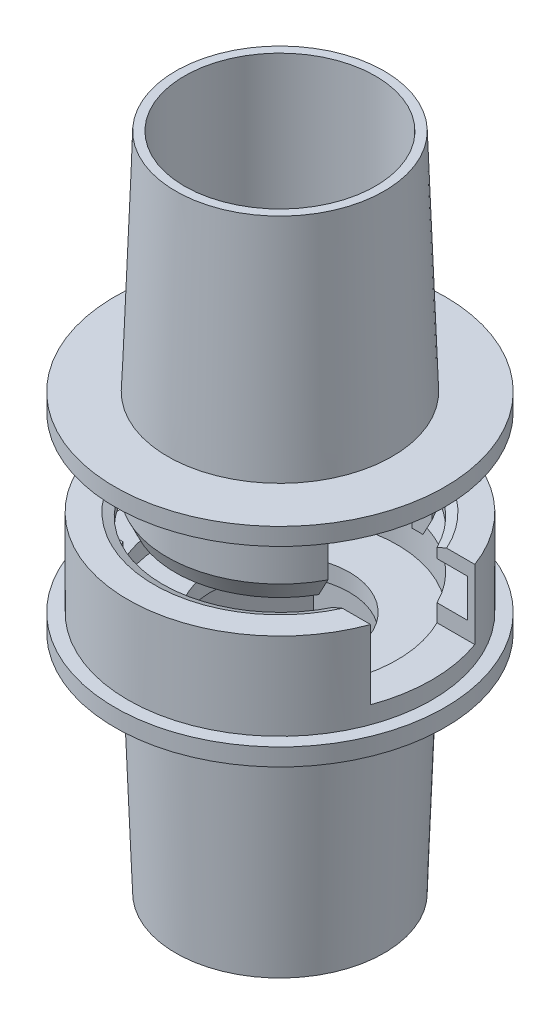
from build123d import *
from OCP.BRepFilletAPI import BRepFilletAPI_MakeChamfer

# Parameters (mm, degrees)
SKETCH4_R           = 6.5
SKETCH4_R_2         = 5.5
CUT_EXTRUDE2_DEPTH  = 28.504545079
SKETCH5_R           = 8.75
SKETCH5_R_2         = 6.75
BOSS_EXTRUDE1_DEPTH = 5
SKETCH6_R           = 8.35
SKETCH6_R_2         = 6.75
CUT_EXTRUDE3_DEPTH  = 2.2
CUT_EXTRUDE1_START  = -4
SKETCH3_W           = 19.395255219
SKETCH3_H           = 6
CUT_EXTRUDE1_DEPTH  = 8
CHAMFER1_SIZE       = 1
CHAMFER1_SIZE2      = 0.466307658
CHAMFER2_SIZE       = 0.5
CHAMFER2_SIZE2      = 0.233153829
SKETCH8_R           = 5.5
BOSS_EXTRUDE2_DEPTH = 13


with BuildPart() as part:
    # Sketch2 → Revolve1 (revolve)
    with BuildSketch(Plane.XY, mode=Mode.PRIVATE) as revolve1_sk:
        Polygon((-5.5, 14), (-6, 14), (-6.464285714, 1), (-9.5, 1), (-9.5, 0), (-6.5, 0), (-6.5, -5), (-5.5, -5), (-5.5, 0), (-4, 0), (-4, 1), (-5.5, 1), align=None)
    revolve(revolve1_sk.sketch.rotate(Axis((0, 0, 0), (0, 1, 0)), 270), axis=Axis((0, 0, 0), (0, 1, 0)))


with BuildPart() as body_2:
    # Mirror1: mirrored copy
    add(part.part.mirror(Plane(origin=(-5.5, -5, 0), x_dir=(0, 0, 1), z_dir=(0, 1, 0))))

    # Sketch4 → Cut-Extrude2 (cut, through all)
    with BuildSketch(Plane(origin=(0, -10, 0), x_dir=(1, 0, 0), z_dir=(0, 1, 0))):
        with Locations(Location((0, 0, 0), (0, 0, 90))):
            Circle(SKETCH4_R)
        with Locations(Location((0, 0, 0), (0, 0, 90))):
            Circle(SKETCH4_R_2, mode=Mode.SUBTRACT)
    extrude(amount=CUT_EXTRUDE2_DEPTH, mode=Mode.SUBTRACT)

    # Sketch5 → Boss-Extrude1 (add)
    with BuildSketch(Plane(origin=(0, -10, 0), x_dir=(1, 0, 0), z_dir=(0, 1, 0))):
        with Locations(Location((0, 0, 0), (0, 0, 270))):
            Circle(SKETCH5_R)
        with Locations(Location((0, 0, 0), (0, 0, 270))):
            Circle(SKETCH5_R_2, mode=Mode.SUBTRACT)
    extrude(amount=BOSS_EXTRUDE1_DEPTH)

    # Sketch6 → Cut-Extrude3 (cut)
    with BuildSketch(Plane(origin=(0, -8, 0), x_dir=(1, 0, 0), z_dir=(0, 1, 0))):
        with Locations(Location((0, 0, 0), (0, 0, 270))):
            Circle(SKETCH6_R)
        with Locations(Location((0, 0, 0), (0, 0, 270))):
            Circle(SKETCH6_R_2, mode=Mode.SUBTRACT)
    extrude(amount=CUT_EXTRUDE3_DEPTH, mode=Mode.SUBTRACT)


with BuildPart() as cut_extrude1_tool:
    # Sketch3 → Cut-Extrude1 (new body)
    with BuildSketch(Plane.XZ.offset(5).offset(CUT_EXTRUDE1_START)):
        with Locations((0.048246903, 0)):
            Rectangle(SKETCH3_W, SKETCH3_H)
    extrude(amount=CUT_EXTRUDE1_DEPTH)


with BuildPart() as part_1:
    add(part.part)

    # Cut-Extrude1: cut by cut_extrude1_tool
    add(cut_extrude1_tool.part, mode=Mode.SUBTRACT)

    # Chamfer1
    chamfer1_edges = [part_1.edges().sort_by_distance(p)[0] for p in [
        (0, -5, 6.5),
        (-3.372684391, -5, -5.556527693),
    ]]
    chamfer1_side = [part_1.faces().sort_by_distance(p)[0] for p in [
        (0, -2.5, 6.5),
    ]]
    chamfer(chamfer1_edges, length=CHAMFER1_SIZE, length2=CHAMFER1_SIZE2, reference=chamfer1_side[0])


with BuildPart() as body_2_1:
    add(body_2.part)

    # Cut-Extrude1: cut by cut_extrude1_tool
    add(cut_extrude1_tool.part, mode=Mode.SUBTRACT)

    # Chamfer2: one chamfer whose edges measure the first distance from different faces: ONE call of the kernel's chamfer builder (chamfer() names one face for all edges)
    chamfer2_edges_1 = [body_2_1.edges().sort_by_distance(p)[0] for p in [
        (0, -5, -6.75),
    ]]
    chamfer2_side_1 = [body_2_1.faces().sort_by_distance(p)[0] for p in [
        (7.133167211, -5, -3.174158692),
    ]]
    chamfer2_edges_2 = [body_2_1.edges().sort_by_distance(p)[0] for p in [
        (0, -5, 6.75),
    ]]
    chamfer2_side_2 = [body_2_1.faces().sort_by_distance(p)[0] for p in [
        (-4.915770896, -5, 7.02710827),
    ]]
    chamfer2 = BRepFilletAPI_MakeChamfer(body_2_1.part.solid().wrapped)
    for e in chamfer2_edges_1:
        chamfer2.Add(CHAMFER2_SIZE, CHAMFER2_SIZE2, e.wrapped, chamfer2_side_1[0].wrapped)  # the first distance lies on this face
    for e in chamfer2_edges_2:
        chamfer2.Add(CHAMFER2_SIZE, CHAMFER2_SIZE2, e.wrapped, chamfer2_side_2[0].wrapped)  # the first distance lies on this face
    add(Compound.cast(chamfer2.Shape()), mode=Mode.REPLACE)

    # Sketch8 → Boss-Extrude2 (add)
    with BuildSketch(Plane.XZ.offset(11)):
        with Locations(Location((0, 0, 0), (0, 0, 270))):
            Circle(SKETCH8_R)
        Polygon((-5.25, 0), (-2.625, -4.54663337), (2.625, -4.54663337), (5.25, 0), (2.625, 4.54663337), (-2.625, 4.54663337), align=None, mode=Mode.SUBTRACT)
    extrude(amount=BOSS_EXTRUDE2_DEPTH)


solid = Compound([part_1.part, body_2_1.part])
